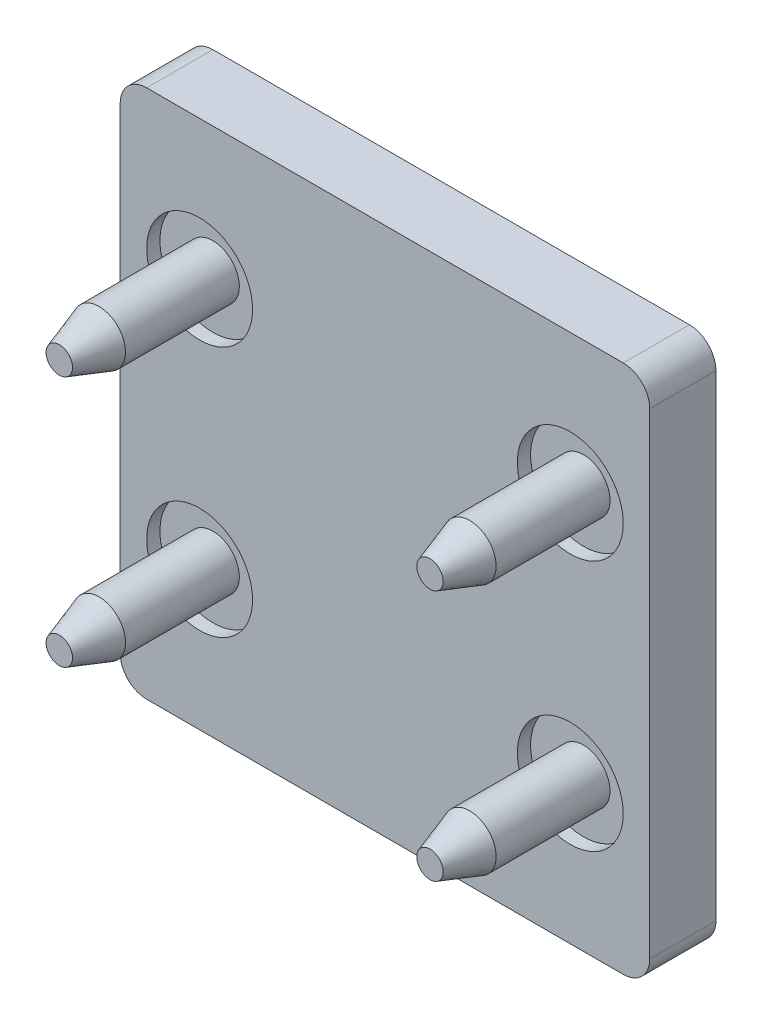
from build123d import *

# Parameters (mm, degrees)
BOSS_EXTRUDE1_DEPTH = 2.5
SKETCH2_W           = 0.5
SKETCH2_H           = 2
SKETCH3_W           = 0.5
SKETCH3_H           = 2
SKETCH4_W           = 0.5
SKETCH4_H           = 2
SKETCH5_W           = 0.5
SKETCH5_H           = 2


with BuildPart() as part:
    # Sketch1 → Boss-Extrude1 (new body)
    with BuildSketch(Plane.XY):
        with BuildLine():
            Line((-10, 9), (-10, -9))
            ThreePointArc((-10, -9), (-9.707106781, -9.707106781), (-9, -10))
            Line((-9, -10), (9, -10))
            ThreePointArc((9, -10), (9.707106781, -9.707106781), (10, -9))
            Line((10, -9), (10, 9))
            ThreePointArc((10, 9), (9.707106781, 9.707106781), (9, 10))
            Line((9, 10), (-9, 10))
            ThreePointArc((-9, 10), (-9.707106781, 9.707106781), (-10, 9))
        make_face()
    extrude(amount=-BOSS_EXTRUDE1_DEPTH)

    # Sketch2 → Cut-Revolve1 (revolve, cut)
    with BuildSketch(Plane(origin=(-7, 0, 0), x_dir=(0, 0, -1), z_dir=(1, 0, 0)), mode=Mode.PRIVATE) as cut_revolve1_sk:
        with Locations((0.25, 5.75)):
            Rectangle(SKETCH2_W, SKETCH2_H)
    revolve(cut_revolve1_sk.sketch.rotate(Axis((-7, 4.75, -0.5), (0, 0, 1)), 270), axis=Axis((-7, 4.75, -0.5), (0, 0, 1)), mode=Mode.SUBTRACT)

    # Sketch3 → Cut-Revolve2 (revolve, cut)
    with BuildSketch(Plane(origin=(7, 0, 0), x_dir=(0, 0, -1), z_dir=(1, 0, 0)), mode=Mode.PRIVATE) as cut_revolve2_sk:
        with Locations((0.25, 5.75)):
            Rectangle(SKETCH3_W, SKETCH3_H)
    revolve(cut_revolve2_sk.sketch.rotate(Axis((7, 4.75, -0.5), (0, 0, 1)), 270), axis=Axis((7, 4.75, -0.5), (0, 0, 1)), mode=Mode.SUBTRACT)

    # Sketch4 → Cut-Revolve3 (revolve, cut)
    with BuildSketch(Plane(origin=(7, 0, 0), x_dir=(0, 0, -1), z_dir=(1, 0, 0)), mode=Mode.PRIVATE) as cut_revolve3_sk:
        with Locations((0.25, -3.75)):
            Rectangle(SKETCH4_W, SKETCH4_H)
    revolve(cut_revolve3_sk.sketch.rotate(Axis((7, -4.75, -0.5), (0, 0, 1)), 270), axis=Axis((7, -4.75, -0.5), (0, 0, 1)), mode=Mode.SUBTRACT)

    # Sketch5 → Cut-Revolve4 (revolve, cut)
    with BuildSketch(Plane(origin=(-7, 0, 0), x_dir=(0, 0, -1), z_dir=(1, 0, 0)), mode=Mode.PRIVATE) as cut_revolve4_sk:
        with Locations((0.25, -3.75)):
            Rectangle(SKETCH5_W, SKETCH5_H)
    revolve(cut_revolve4_sk.sketch.rotate(Axis((-7, -4.75, -0.5), (0, 0, 1)), 270), axis=Axis((-7, -4.75, -0.5), (0, 0, 1)), mode=Mode.SUBTRACT)

    # Sketch6 → Revolve1 (revolve)
    with BuildSketch(Plane(origin=(-7, 0, 0), x_dir=(0, 0, -1), z_dir=(1, 0, 0)), mode=Mode.PRIVATE) as revolve1_sk:
        Polygon((-5.3, 4.75), (-5.3, 5.25), (-3.8, 5.75), (0.5, 5.75), (0.5, 4.75), align=None)
    revolve(revolve1_sk.sketch.rotate(Axis((-7, 4.75, -0.5), (0, 0, 1)), 270), axis=Axis((-7, 4.75, -0.5), (0, 0, 1)))

    # Sketch7 → Revolve2 (revolve)
    with BuildSketch(Plane(origin=(7, 0, 0), x_dir=(0, 0, -1), z_dir=(1, 0, 0)), mode=Mode.PRIVATE) as revolve2_sk:
        Polygon((-5.3, 4.75), (-5.3, 5.25), (-3.8, 5.75), (0.5, 5.75), (0.5, 4.75), align=None)
    revolve(revolve2_sk.sketch.rotate(Axis((7, 4.75, -0.5), (0, 0, 1)), 270), axis=Axis((7, 4.75, -0.5), (0, 0, 1)))

    # Sketch8 → Revolve3 (revolve)
    with BuildSketch(Plane(origin=(7, 0, 0), x_dir=(0, 0, -1), z_dir=(1, 0, 0)), mode=Mode.PRIVATE) as revolve3_sk:
        Polygon((-5.3, -4.75), (-5.3, -4.25), (-3.8, -3.75), (0.5, -3.75), (0.5, -4.75), align=None)
    revolve(revolve3_sk.sketch.rotate(Axis((7, -4.75, -0.5), (0, 0, 1)), 270), axis=Axis((7, -4.75, -0.5), (0, 0, 1)))

    # Sketch9 → Revolve4 (revolve)
    with BuildSketch(Plane(origin=(-7, 0, 0), x_dir=(0, 0, -1), z_dir=(1, 0, 0)), mode=Mode.PRIVATE) as revolve4_sk:
        Polygon((-5.3, -4.75), (-5.3, -4.25), (-3.8, -3.75), (0.5, -3.75), (0.5, -4.75), align=None)
    revolve(revolve4_sk.sketch.rotate(Axis((-7, -4.75, -0.5), (0, 0, 1)), 270), axis=Axis((-7, -4.75, -0.5), (0, 0, 1)))


solid = part.part
